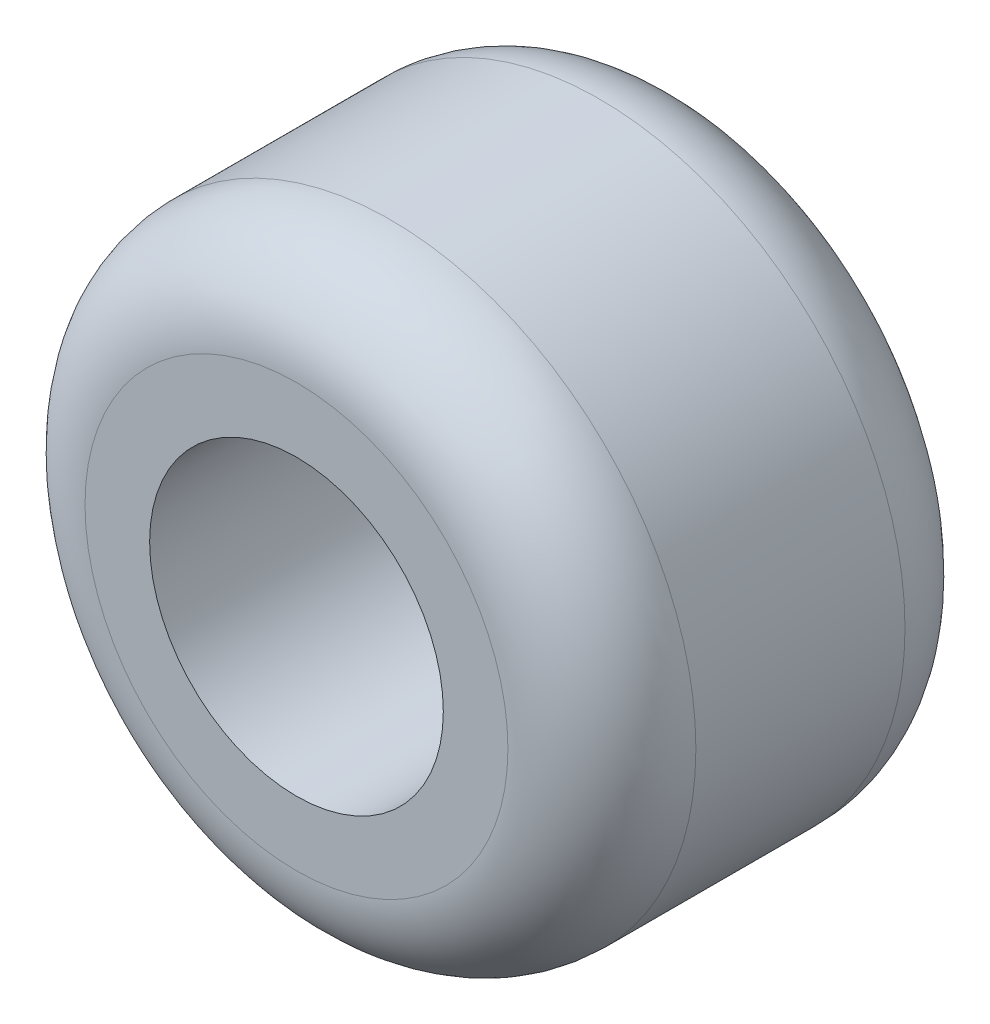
from build123d import *

# Parameters (mm, degrees)
ESQUISSE1_R          = 130
ESQUISSE1_R_2        = 62.5
BASE_EXTRUSION_DEPTH = 169
CONG_1_R             = 40


with BuildPart() as part:
    # Esquisse1 → Base-Extrusion (new body)
    with BuildSketch(Plane.XY):
        Circle(ESQUISSE1_R)
        Circle(ESQUISSE1_R_2, mode=Mode.SUBTRACT)
    extrude(amount=BASE_EXTRUSION_DEPTH)

    # Cong_1
    cong_1_edges = [part.edges().sort_by_distance(p)[0] for p in [
        (-130, 0, 0),
        (-130, 0, 169),
    ]]
    fillet(cong_1_edges, radius=CONG_1_R)


solid = part.part
